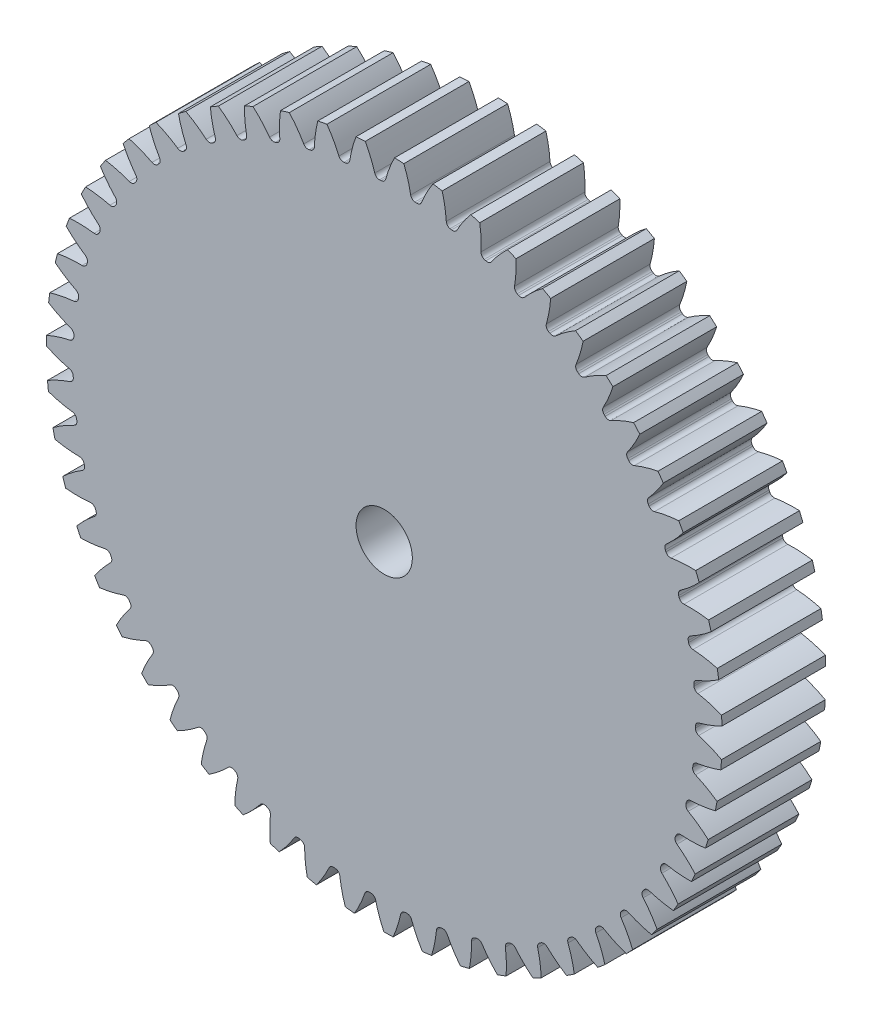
from build123d import *

# Parameters (mm, degrees)
SKETCH3_R         = 289.56
GEARBODY_DEPTH    = 88.9
TOOTHCUT_DEPTH    = 420.038419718
CIRPATTERN1_COUNT = 55
BOREDIA_R         = 24.13
BORE_DEPTH        = 12700


with BuildPart() as part:
    # Sketch3 → gearBody (new body)
    with BuildSketch(Plane.XY):
        Circle(SKETCH3_R)
    extrude(amount=GEARBODY_DEPTH)

    # Sketch2 → toothCut (cut, through all)
    with BuildSketch(Plane.XY):
        with BuildLine():
            ThreePointArc((266.654661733, -4.917456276), (266.666308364, -4.23910173), (266.676229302, -3.560719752))
            ThreePointArc((266.676229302, -3.560719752), (267.543208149, -1.081982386), (269.72801793, 0.374862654))
            ThreePointArc((269.72801793, 0.374862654), (279.840144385, 3.684428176), (289.56, 8.012560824))
            ThreePointArc((289.56, 8.012560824), (289.6342451, -4.604215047), (289.159009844, -17.212256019))
            ThreePointArc((289.159009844, -17.212256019), (279.581636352, -12.577362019), (269.579814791, -8.948052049))
            ThreePointArc((269.579814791, -8.948052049), (267.442415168, -7.422498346), (266.654661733, -4.917456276))
        make_face()
    toothcut = extrude(amount=TOOTHCUT_DEPTH, mode=Mode.SUBTRACT)

    # CirPattern1: toothCut ×55 about axis
    cirpattern1_axis = Axis((0, 0, 0), (0, 0, 1))
    for i in range(1, CIRPATTERN1_COUNT):
        add(toothcut.rotate(cirpattern1_axis, i * 360 / CIRPATTERN1_COUNT), mode=Mode.SUBTRACT)

    # boreDia → bore (cut, symmetric)
    with BuildSketch(Plane.XY):
        Circle(BOREDIA_R)
    extrude(amount=BORE_DEPTH, both=True, mode=Mode.SUBTRACT)


solid = part.part
